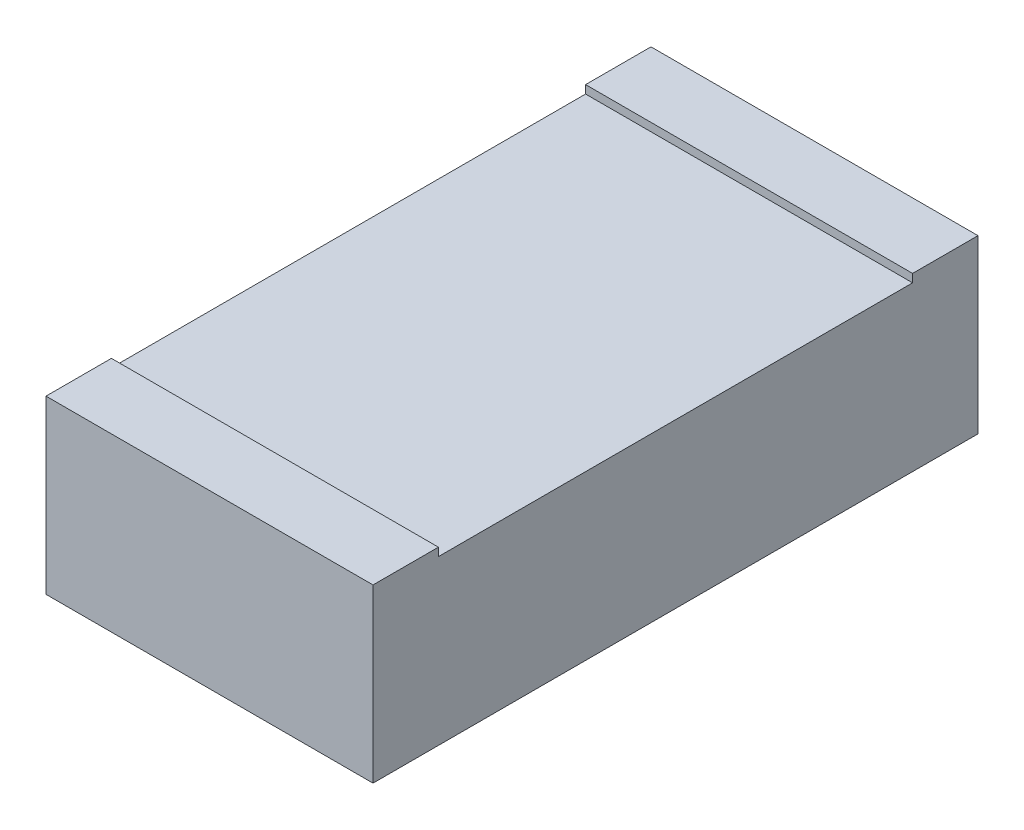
from build123d import *

# Parameters (mm, degrees)
ESQUISSE1_W        = 1
ESQUISSE1_H        = 1.85
BOSS_EXTRU_1_DEPTH = 0.5
ESQUISSE2_W        = 1
ESQUISSE2_H        = 0.2
BOSS_EXTRU_2_DEPTH = 0.025


with BuildPart() as part:
    # Esquisse1 → Boss.-Extru.1 (new body)
    with BuildSketch(Plane(origin=(0, 0, 0), x_dir=(1, 0, 0), z_dir=(0, 1, 0))):
        Rectangle(ESQUISSE1_W, ESQUISSE1_H)
    extrude(amount=BOSS_EXTRU_1_DEPTH)

    # Esquisse2 → Boss.-Extru.2 (add)
    with BuildSketch(Plane(origin=(0, 0.5, 0), x_dir=(1, 0, 0), z_dir=(0, 1, 0))):
        with Locations((0, 0.825)):
            Rectangle(ESQUISSE2_W, ESQUISSE2_H)
        with Locations((0, -0.825)):
            Rectangle(ESQUISSE2_W, ESQUISSE2_H)
    extrude(amount=BOSS_EXTRU_2_DEPTH)


solid = part.part
